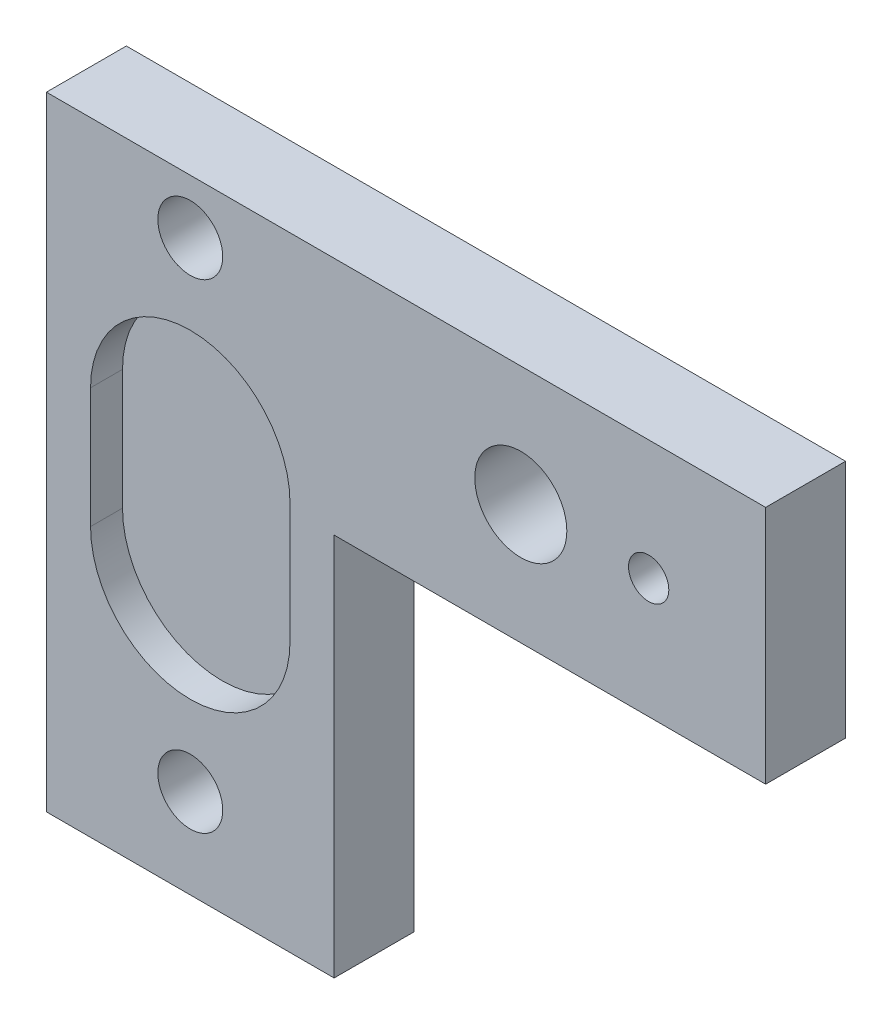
from build123d import *

# Parameters (mm, degrees)
SKETCH1_R                 = 0.8001
EXTRUDE1_DEPTH            = 3.175
F_5_40_TAPPED_HOLE1_D     = 2.5781
F_5_40_TAPPED_HOLE1_DEPTH = 9.525
F_5_40_TAPPED_HOLE1_TIP   = 0.774539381
F_6_CLEARANCE_HOLE1_D     = 3.6576
F_6_CLEARANCE_HOLE1_DEPTH = 17.78
F_6_CLEARANCE_HOLE1_TIP   = 1.0988539
EXTRUDE2_DEPTH            = 1.27


with BuildPart() as part:
    # Sketch1 → Extrude1 (new body)
    with BuildSketch(Plane.XY):
        Polygon((0, 0), (28.575, 0), (28.575, -9.525), (11.43, -9.525), (11.43, -24.765), (0, -24.765), align=None)
        with Locations((23.9268, -4.7625)):
            Circle(SKETCH1_R, mode=Mode.SUBTRACT)
    extrude(amount=EXTRUDE1_DEPTH)

    # 5-40 Tapped Hole1
    with Locations(Plane(origin=(5.715, -2.159, 3.175), x_dir=(1, 0, 0), z_dir=(0, 0, 1))):
        with Locations((0, 0), (0, -19.05)):
            Hole(F_5_40_TAPPED_HOLE1_D / 2, depth=F_5_40_TAPPED_HOLE1_DEPTH)
            with Locations((0, 0, -(F_5_40_TAPPED_HOLE1_DEPTH + F_5_40_TAPPED_HOLE1_TIP / 2))):  # 118° drill point
                Cone(0, F_5_40_TAPPED_HOLE1_D / 2, F_5_40_TAPPED_HOLE1_TIP, mode=Mode.SUBTRACT)

    # 6 Clearance Hole1
    with Locations(Plane(origin=(18.8468, -4.7625, 3.175), x_dir=(1, 0, 0), z_dir=(0, 0, 1))):
        with Locations((0, 0)):
            Hole(F_6_CLEARANCE_HOLE1_D / 2, depth=F_6_CLEARANCE_HOLE1_DEPTH)
            with Locations((0, 0, -(F_6_CLEARANCE_HOLE1_DEPTH + F_6_CLEARANCE_HOLE1_TIP / 2))):  # 118° drill point
                Cone(0, F_6_CLEARANCE_HOLE1_D / 2, F_6_CLEARANCE_HOLE1_TIP, mode=Mode.SUBTRACT)

    # Sketch4 → Extrude2 (cut)
    with BuildSketch(Plane.XY.offset(3.175)):
        with BuildLine():
            Line((1.7526, -9.2964), (1.7526, -14.0716))
            ThreePointArc((1.7526, -14.0716), (5.715, -18.034), (9.6774, -14.0716))
            Line((9.6774, -14.0716), (9.6774, -9.2964))
            ThreePointArc((9.6774, -9.2964), (5.715, -5.334), (1.7526, -9.2964))
        make_face()
    extrude(amount=-EXTRUDE2_DEPTH, mode=Mode.SUBTRACT)


solid = part.part
